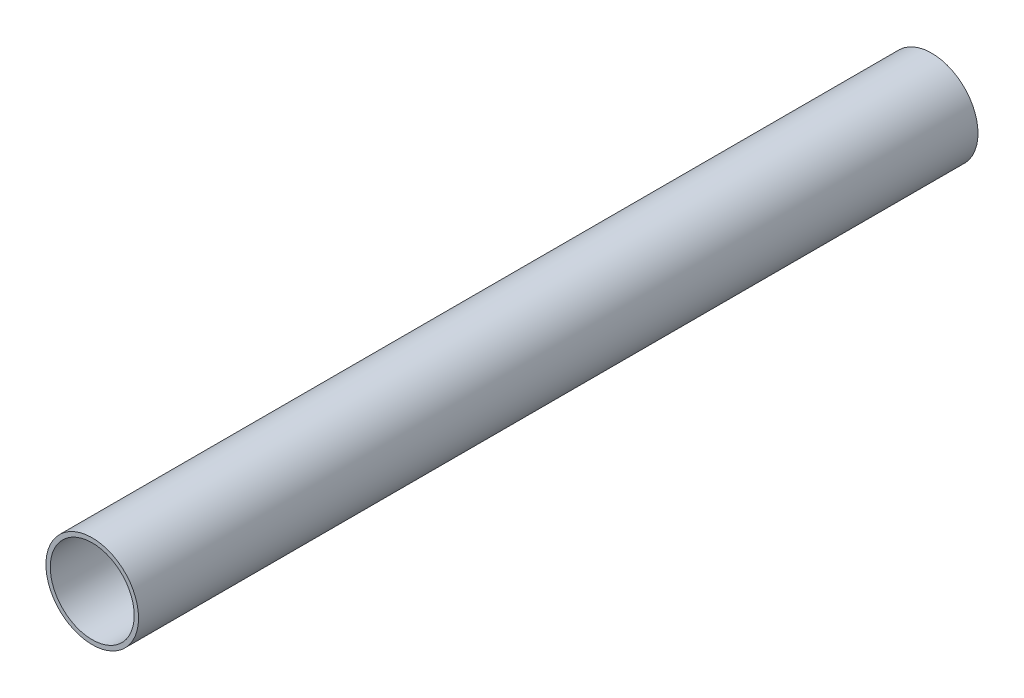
from build123d import *

# Parameters (mm, degrees)
SKETCH1_R          = 8
EXTRUDE1_DEPTH     = 145
SKETCH2_R          = 7.25
CUT_EXTRUDE1_DEPTH = 146.440709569


with BuildPart() as part:
    # Sketch1 → Extrude1 (new body)
    with BuildSketch(Plane.XY):
        Circle(SKETCH1_R)
    extrude(amount=-EXTRUDE1_DEPTH)

    # Sketch2 → Cut-Extrude1 (cut, through all)
    with BuildSketch(Plane.XY):
        Circle(SKETCH2_R)
    extrude(amount=-CUT_EXTRUDE1_DEPTH, mode=Mode.SUBTRACT)


solid = part.part
